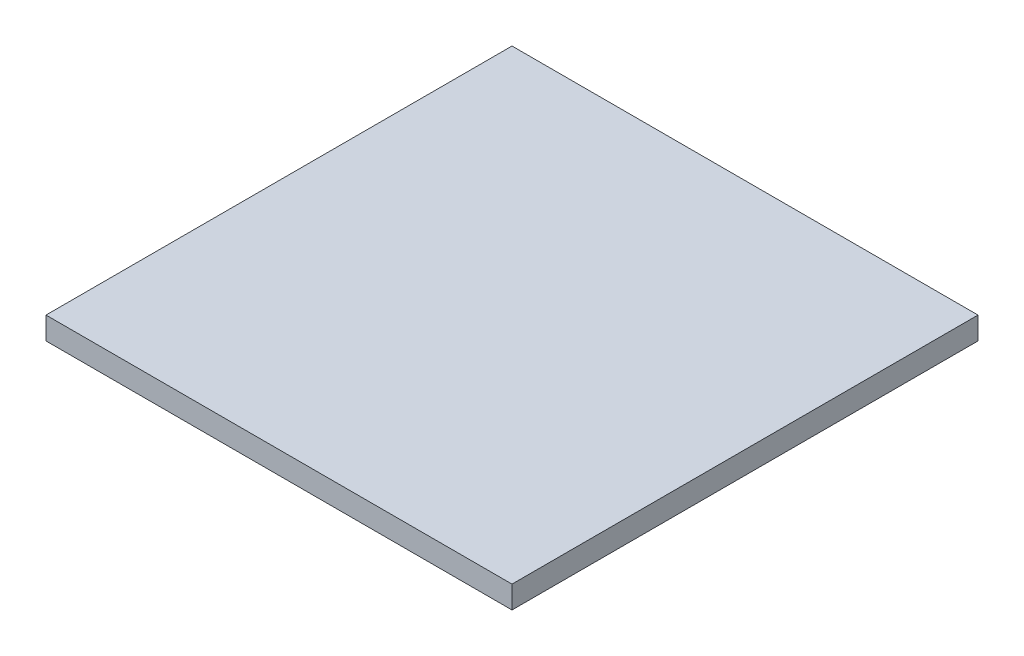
from build123d import *

# Parameters (mm, degrees)
SKETCH1_W           = 27
SKETCH1_H           = 27
BOSS_EXTRUDE1_DEPTH = 1.3


with BuildPart() as part:
    # Sketch1 → Boss-Extrude1 (new body)
    with BuildSketch(Plane(origin=(0, 0, 0), x_dir=(1, 0, 0), z_dir=(0, 1, 0))):
        Rectangle(SKETCH1_W, SKETCH1_H)
    extrude(amount=BOSS_EXTRUDE1_DEPTH)


solid = part.part
